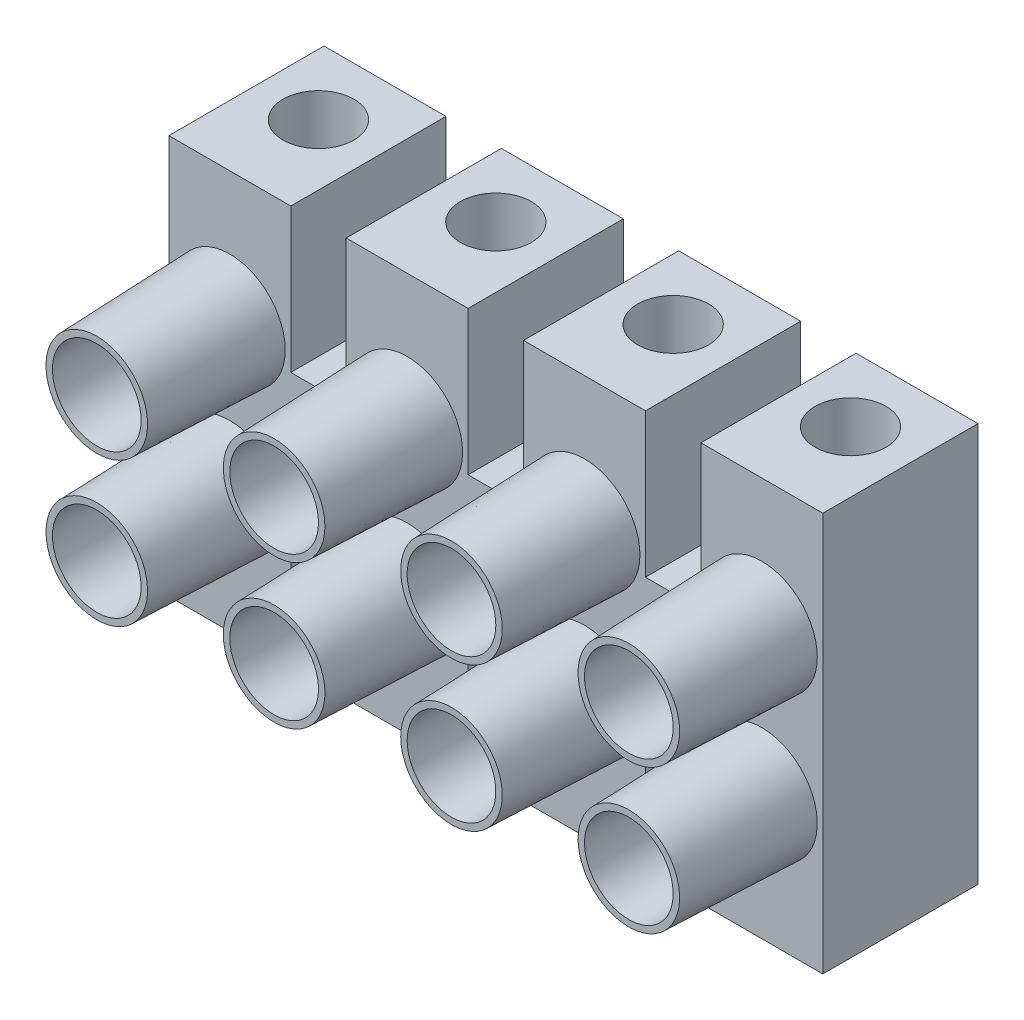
from build123d import *

# Parameters (mm, degrees)
ESQUISSE1_R             = 1.6
BASE_EXTRUSION_DEPTH    = 7
ESQUISSE2_R             = 2.5
ESQUISSE2_R_2           = 2
BOSS_EXTRU_1_DEPTH      = 6
D_POUILLE1_ANGLE        = 2
ESQUISSE3_R             = 1.6
ENL_V_MAT_EXTRU_1_DEPTH = 37.922215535


with BuildPart() as part:
    # Esquisse1 → Base-Extrusion (new body)
    with BuildSketch(Plane.XY):
        Polygon((0, 2.5), (0, 9), (5.5, 9), (5.5, 2.5), (8, 2.5), (8, 9), (13.5, 9), (13.5, 2.5), (16, 2.5), (16, 9), (21.5, 9), (21.5, 2.5), (24, 2.5), (24, 9), (29.5, 9), (29.5, -9), (24, -9), (24, -2.5), (21.5, -2.5), (21.5, -9), (16, -9), (16, -2.5), (13.5, -2.5), (13.5, -9), (8, -9), (8, -2.5), (5.5, -2.5), (5.5, -9), (0, -9), (0, -2.5), align=None)
        with Locations((6.75, 0)):
            Circle(ESQUISSE1_R, mode=Mode.SUBTRACT)
        with Locations((14.75, 0)):
            Circle(ESQUISSE1_R, mode=Mode.SUBTRACT)
        with Locations((22.75, 0)):
            Circle(ESQUISSE1_R, mode=Mode.SUBTRACT)
    extrude(amount=BASE_EXTRUSION_DEPTH)

    # Esquisse2 → Boss.-Extru.1 (add)
    # profile 1 of 9: a face of its own
    with BuildSketch(Plane.XY.offset(7)):
        with Locations((2.75, 3.25)):
            Circle(ESQUISSE2_R)
        with Locations((2.75, 3.25)):
            Circle(ESQUISSE2_R_2, mode=Mode.SUBTRACT)
    # profile 2 of 9: a face of its own
    with BuildSketch(Plane.XY.offset(7)):
        with Locations((10.75, 3.25)):
            Circle(ESQUISSE2_R)
        with Locations((10.75, 3.25)):
            Circle(ESQUISSE2_R_2, mode=Mode.SUBTRACT)
    # profile 3 of 9: a face of its own
    with BuildSketch(Plane.XY.offset(7)):
        with Locations((18.75, 3.25)):
            Circle(ESQUISSE2_R)
        with Locations((18.75, 3.25)):
            Circle(ESQUISSE2_R_2, mode=Mode.SUBTRACT)
    # profile 4 of 9: a face of its own
    with BuildSketch(Plane.XY.offset(7)):
        with Locations((26.75, 3.25)):
            Circle(ESQUISSE2_R)
        with Locations((26.75, 3.25)):
            Circle(ESQUISSE2_R_2, mode=Mode.SUBTRACT)
    # profile 5 of 9: a face of its own
    with BuildSketch(Plane.XY.offset(7)):
        with Locations(Location((26.75, -3.25, 0), (0, 0, 180))):
            Circle(ESQUISSE2_R)
        with Locations(Location((26.75, -3.25, 0), (0, 0, 180))):
            Circle(ESQUISSE2_R_2, mode=Mode.SUBTRACT)
    # profile 6 of 9: a face of its own
    with BuildSketch(Plane.XY.offset(7)):
        with Locations(Location((18.75, -3.25, 0), (0, 0, 180))):
            Circle(ESQUISSE2_R)
        with Locations(Location((18.75, -3.25, 0), (0, 0, 180))):
            Circle(ESQUISSE2_R_2, mode=Mode.SUBTRACT)
    # profile 7 of 9: a face of its own
    with BuildSketch(Plane.XY.offset(7)):
        with Locations(Location((10.75, -3.25, 0), (0, 0, 180))):
            Circle(ESQUISSE2_R)
        with Locations(Location((10.75, -3.25, 0), (0, 0, 180))):
            Circle(ESQUISSE2_R_2, mode=Mode.SUBTRACT)
    # profile 8 of 9: a face of its own
    with BuildSketch(Plane.XY.offset(7)):
        with Locations(Location((2.75, -3.25, 0), (0, 0, 180))):
            Circle(ESQUISSE2_R)
        with Locations(Location((2.75, -3.25, 0), (0, 0, 180))):
            Circle(ESQUISSE2_R_2, mode=Mode.SUBTRACT)
    # profile 9 of 9: a face of its own
    with BuildSketch(Plane.XY.offset(7)):
        with Locations((34.75, 3.25)):
            Circle(ESQUISSE2_R)
        with Locations((34.75, 3.25)):
            Circle(ESQUISSE2_R_2, mode=Mode.SUBTRACT)
    extrude(amount=BOSS_EXTRU_1_DEPTH)


with BuildPart() as boss_extru_1_kept_piece:
    # of the separate pieces the step leaves, the one the design keeps (boss_extru_1_pieces_kept)
    add(part.part.solids().sort_by_distance((0, 9, 0))[0])

    # D_pouille1
    d_pouille1_faces = [boss_extru_1_kept_piece.faces().sort_by_distance(p)[0] for p in [
        (0.25, 3.25, 10),
        (5.25, -3.25, 10),
        (8.25, 3.25, 10),
        (13.25, -3.25, 10),
        (21.25, -3.25, 10),
        (16.25, 3.25, 10),
        (24.25, 3.25, 10),
        (29.25, -3.25, 10),
    ]]
    draft(d_pouille1_faces, Plane(origin=(0, -9, 7), x_dir=(1, 0, 0), z_dir=(0, 0, 1)), D_POUILLE1_ANGLE)

    # Esquisse3 → Enl_v. mat.-Extru.1 (cut, through all)
    with BuildSketch(Plane.XZ.offset(9)):
        with Locations(Location((2.75, 3, 0), (0, 0, 270))):
            Circle(ESQUISSE3_R)
        with Locations(Location((10.75, 3, 0), (0, 0, 270))):
            Circle(ESQUISSE3_R)
        with Locations(Location((18.75, 3, 0), (0, 0, 270))):
            Circle(ESQUISSE3_R)
        with Locations(Location((26.75, 3, 0), (0, 0, 270))):
            Circle(ESQUISSE3_R)
        with Locations((34.75, 3)):
            Circle(ESQUISSE3_R)
    extrude(amount=-ENL_V_MAT_EXTRU_1_DEPTH, mode=Mode.SUBTRACT)


solid = boss_extru_1_kept_piece.part
